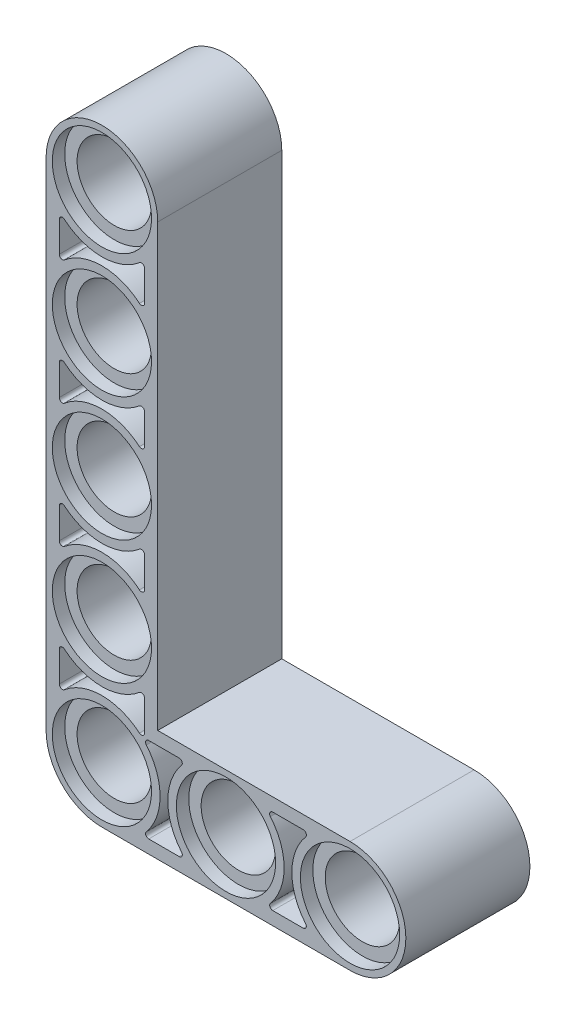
from build123d import *

# Parameters (mm, degrees)
BASE_BODY_DEPTH                         = 4
VERTICAL_BODY_DEPTH                     = 8
CBORE_FOR_M5_HEX_HEAD_BOLT1_D           = 4.8
CBORE_FOR_M5_HEX_HEAD_BOLT1_CBORE_D     = 6.4
CBORE_FOR_M5_HEX_HEAD_BOLT1_CBORE_DEPTH = 0.8
CBORE_FOR_M5_HEX_HEAD_BOLT2_D           = 4.8
CBORE_FOR_M5_HEX_HEAD_BOLT2_CBORE_D     = 6.4
CBORE_FOR_M5_HEX_HEAD_BOLT2_CBORE_DEPTH = 0.8
VERTICAL_HOLE_PATTERN_COUNT             = 5
VERTICAL_HOLE_PATTERN_PITCH             = 8
HORIZONTAL_HOLE_PATTERN_COUNT           = 3
HORIZONTAL_HOLE_PATTERN_PITCH           = 8
HOURGLASS_CUT_DEPTH                     = 3.2
HOURGLASS_BASE_PATTERN_COUNT            = 2
HOURGLASS_BASE_PATTERN_PITCH            = 4.8
HOURGLASS_BASE_PATTERN_COUNT_DIR2       = 2
HOURGLASS_BASE_PATTERN_PITCH_DIR2       = 8
HOURGLASS_CUT_2_DEPTH                   = 3.2
HOURGLASS_VERTICAL_PATTERN_COUNT        = 4
HOURGLASS_VERTICAL_PATTERN_PITCH        = 8
HOURGLASS_VERTICAL_PATTERN_COUNT_DIR2   = 2
HOURGLASS_VERTICAL_PATTERN_PITCH_DIR2   = 4.8


with BuildPart() as part:
    # Sketch2 → Base Body (new, symmetric)
    with BuildSketch(Plane.XY):
        with BuildLine():
            Line((0, 3.6), (16, 3.6))
            ThreePointArc((16, 3.6), (19.6, 0), (16, -3.6))
            Line((16, -3.6), (0, -3.6))
            ThreePointArc((0, -3.6), (-3.6, 0), (0, 3.6))
        make_face()
    extrude(amount=BASE_BODY_DEPTH, both=True)

    # Sketch3 → Vertical Body (add)
    with BuildSketch(Plane.XY.offset(4)):
        with BuildLine():
            Line((3.6, 32), (3.6, 0))
            ThreePointArc((3.6, 0), (0, -3.6), (-3.6, 0))
            Line((-3.6, 0), (-3.6, 32))
            ThreePointArc((-3.6, 32), (0, 35.6), (3.6, 32))
        make_face()
    extrude(amount=-VERTICAL_BODY_DEPTH)

    # CBORE for M5 Hex Head Bolt1 (through all)
    with Locations(Plane.XY.offset(4)):
        with Locations((0, 0)):
            cbore_for_m5_hex_head_bolt1 = CounterBoreHole(CBORE_FOR_M5_HEX_HEAD_BOLT1_D / 2, CBORE_FOR_M5_HEX_HEAD_BOLT1_CBORE_D / 2, CBORE_FOR_M5_HEX_HEAD_BOLT1_CBORE_DEPTH)

    # CBORE for M5 Hex Head Bolt2 (through all)
    with Locations(Plane(origin=(0, 0, -4), x_dir=(-1, 0, 0), z_dir=(0, 0, -1))):
        with Locations((0, 0)):
            cbore_for_m5_hex_head_bolt2 = CounterBoreHole(CBORE_FOR_M5_HEX_HEAD_BOLT2_D / 2, CBORE_FOR_M5_HEX_HEAD_BOLT2_CBORE_D / 2, CBORE_FOR_M5_HEX_HEAD_BOLT2_CBORE_DEPTH)

    # Vertical Hole Pattern: CBORE for M5 Hex Head Bolt1, CBORE for M5 Hex Head Bolt2 ×5
    with Locations(*[(0, i * VERTICAL_HOLE_PATTERN_PITCH, 0) for i in range(1, VERTICAL_HOLE_PATTERN_COUNT)]):
        add(cbore_for_m5_hex_head_bolt1, mode=Mode.SUBTRACT)
        add(cbore_for_m5_hex_head_bolt2, mode=Mode.SUBTRACT)

    # Horizontal Hole Pattern: CBORE for M5 Hex Head Bolt1, CBORE for M5 Hex Head Bolt2 ×3
    with Locations(*[(i * HORIZONTAL_HOLE_PATTERN_PITCH, 0, 0) for i in range(1, HORIZONTAL_HOLE_PATTERN_COUNT)]):
        add(cbore_for_m5_hex_head_bolt1, mode=Mode.SUBTRACT)
        add(cbore_for_m5_hex_head_bolt2, mode=Mode.SUBTRACT)

    # Sketch7 → Hourglass Cut (cut)
    with BuildSketch(Plane.XY.offset(4)):
        with BuildLine():
            Line((3.016620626, -2.75), (4.983379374, -2.75))
            ThreePointArc((4.983379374, -2.75), (5.164794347, -2.634193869), (5.136119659, -2.420886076))
            ThreePointArc((5.136119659, -2.420886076), (4.25, 0), (5.136119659, 2.420886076))
            ThreePointArc((5.136119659, 2.420886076), (5.164794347, 2.634193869), (4.983379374, 2.75))
            Line((4.983379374, 2.75), (3.016620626, 2.75))
            ThreePointArc((3.016620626, 2.75), (2.835205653, 2.634193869), (2.863880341, 2.420886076))
            ThreePointArc((2.863880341, 2.420886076), (3.75, 0), (2.863880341, -2.420886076))
            ThreePointArc((2.863880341, -2.420886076), (2.835205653, -2.634193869), (3.016620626, -2.75))
        make_face()
    hourglass_cut = extrude(amount=-HOURGLASS_CUT_DEPTH, mode=Mode.SUBTRACT)

    # Hourglass Base Pattern: Hourglass Cut 2 × 2
    with Locations(*[(j * HOURGLASS_BASE_PATTERN_PITCH_DIR2, 0, -i * HOURGLASS_BASE_PATTERN_PITCH) for i in range(HOURGLASS_BASE_PATTERN_COUNT) for j in range(HOURGLASS_BASE_PATTERN_COUNT_DIR2) if (i, j) != (0, 0)]):
        add(hourglass_cut, mode=Mode.SUBTRACT)

    # Sketch8 → Hourglass Cut 2 (cut)
    with BuildSketch(Plane.XY.offset(4)):
        with BuildLine():
            Line((2.75, 4.983379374), (2.75, 3.016620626))
            ThreePointArc((2.75, 3.016620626), (2.634193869, 2.835205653), (2.420886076, 2.863880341))
            ThreePointArc((2.420886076, 2.863880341), (0, 3.75), (-2.420886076, 2.863880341))
            ThreePointArc((-2.420886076, 2.863880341), (-2.634193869, 2.835205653), (-2.75, 3.016620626))
            Line((-2.75, 3.016620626), (-2.75, 4.983379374))
            ThreePointArc((-2.75, 4.983379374), (-2.634193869, 5.164794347), (-2.420886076, 5.136119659))
            ThreePointArc((-2.420886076, 5.136119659), (0, 4.25), (2.420886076, 5.136119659))
            ThreePointArc((2.420886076, 5.136119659), (2.634193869, 5.164794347), (2.75, 4.983379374))
        make_face()
    hourglass_cut_2 = extrude(amount=-HOURGLASS_CUT_2_DEPTH, mode=Mode.SUBTRACT)

    # Hourglass Vertical Pattern: Hourglass Cut 2 4 × 2
    with Locations(*[(0, i * HOURGLASS_VERTICAL_PATTERN_PITCH, -j * HOURGLASS_VERTICAL_PATTERN_PITCH_DIR2) for i in range(HOURGLASS_VERTICAL_PATTERN_COUNT) for j in range(HOURGLASS_VERTICAL_PATTERN_COUNT_DIR2) if (i, j) != (0, 0)]):
        add(hourglass_cut_2, mode=Mode.SUBTRACT)


solid = part.part
